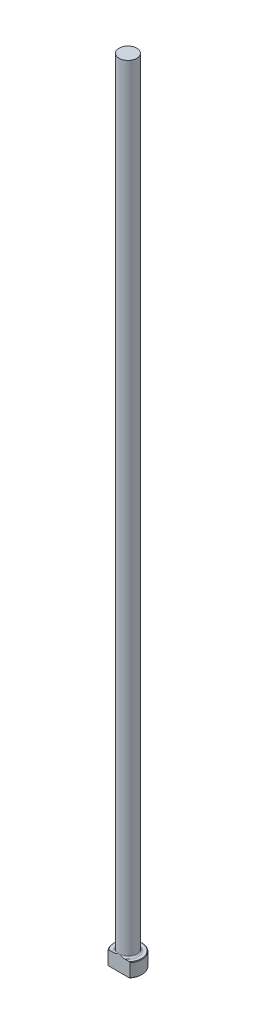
from build123d import *

# Parameters (mm, degrees)
CHAMFER1_SIZE = 0.254
FILLET1_R     = 0.762
KEY_DEPTH     = 356.713374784


with BuildPart() as part:
    # Sketch1 → Revolve1 (revolve)
    with BuildSketch(Plane.XY, mode=Mode.PRIVATE) as revolve1_sk:
        Polygon((0, 0), (-6.35, 0), (-6.35, 6.35), (-3.96875, 6.35), (-3.96875, 355.6), (0, 355.6), align=None)
    revolve(revolve1_sk.sketch.rotate(Axis((0, 259.958771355, 0), (0, -1, 0)), 270), axis=Axis((0, 259.958771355, 0), (0, -1, 0)))

    # Chamfer1
    chamfer1_edges = [part.edges().sort_by_distance(p)[0] for p in [
        (0, 6.35, -6.35),
        (0, 0, -6.35),
    ]]
    chamfer(chamfer1_edges, length=CHAMFER1_SIZE)

    # Fillet1
    fillet1_edges = [part.edges().sort_by_distance(p)[0] for p in [
        (0, 6.35, -3.96875),
    ]]
    fillet(fillet1_edges, radius=FILLET1_R)

    # Sketch2 → Key (cut, through all)
    with BuildSketch(Plane(origin=(0, 0, 0), x_dir=(1, 0, 0), z_dir=(0, 1, 0))):
        with BuildLine():
            Line((-4.956967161, -3.96875), (4.956967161, -3.96875))
            ThreePointArc((4.956967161, -3.96875), (0, -6.35), (-4.956967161, -3.96875))
        make_face()
    extrude(amount=KEY_DEPTH, mode=Mode.SUBTRACT)


solid = part.part
